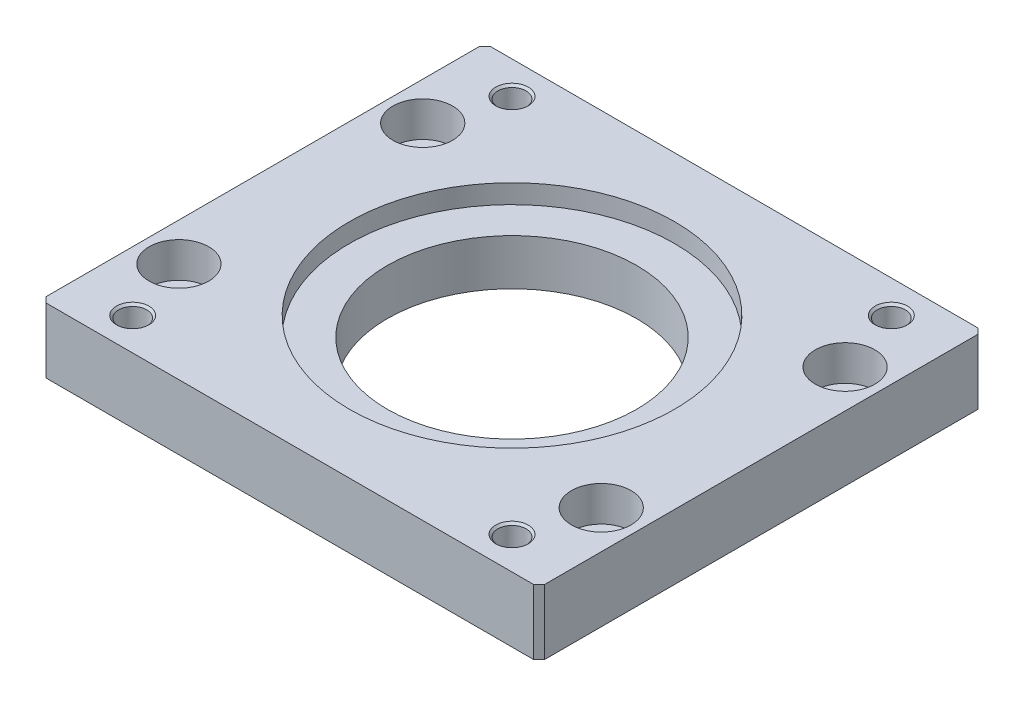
ISO-10303-21;
HEADER;
FILE_DESCRIPTION(('STEP AP214'),'2;1');
FILE_NAME('part.step','',(''),(''),'','','');
FILE_SCHEMA(('AUTOMOTIVE_DESIGN { 1 0 10303 214 1 1 1 1 }'));
ENDSEC;
DATA;
#1=APPLICATION_CONTEXT('core data for automotive mechanical design processes');
#2=APPLICATION_PROTOCOL_DEFINITION('international standard','automotive_design',2000,#1);
#3=PRODUCT_CONTEXT('',#1,'mechanical');
#4=PRODUCT('Part','Part','',(#3));
#5=PRODUCT_RELATED_PRODUCT_CATEGORY('part','',(#4));
#6=PRODUCT_DEFINITION_FORMATION('','',#4);
#7=PRODUCT_DEFINITION_CONTEXT('part definition',#1,'design');
#8=PRODUCT_DEFINITION('design','',#6,#7);
#9=PRODUCT_DEFINITION_SHAPE('','',#8);
#10=(LENGTH_UNIT() NAMED_UNIT(*) SI_UNIT(.MILLI.,.METRE.));
#11=(NAMED_UNIT(*) PLANE_ANGLE_UNIT() SI_UNIT($,.RADIAN.));
#12=(NAMED_UNIT(*) SI_UNIT($,.STERADIAN.) SOLID_ANGLE_UNIT());
#13=UNCERTAINTY_MEASURE_WITH_UNIT(LENGTH_MEASURE(1.E-05),#10,'distance_accuracy_value','');
#14=(GEOMETRIC_REPRESENTATION_CONTEXT(3) GLOBAL_UNCERTAINTY_ASSIGNED_CONTEXT((#13)) GLOBAL_UNIT_ASSIGNED_CONTEXT((#10,
#11,#12)) REPRESENTATION_CONTEXT('',''));
#15=CARTESIAN_POINT('',(0.,0.,0.));
#16=DIRECTION('',(0.,0.,1.));
#17=DIRECTION('',(1.,0.,0.));
#18=AXIS2_PLACEMENT_3D('',#15,#16,#17);
#19=CARTESIAN_POINT('',(-35.,11.6,35.));
#20=DIRECTION('',(0.,1.,0.));
#21=DIRECTION('',(0.,0.,1.));
#22=AXIS2_PLACEMENT_3D('',#19,#20,#21);
#23=CONICAL_SURFACE('',#22,2.59999999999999,0.785398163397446);
#24=CARTESIAN_POINT('',(-35.,11.6,35.));
#25=DIRECTION('',(0.,1.,0.));
#26=DIRECTION('',(1.,0.,0.));
#27=AXIS2_PLACEMENT_3D('',#24,#25,#26);
#28=CIRCLE('',#27,2.6);
#29=CARTESIAN_POINT('',(-32.4,11.6,35.));
#30=VERTEX_POINT('',#29);
#31=EDGE_CURVE('E169',#30,#30,#28,.F.);
#32=ORIENTED_EDGE('',*,*,#31,.T.);
#33=EDGE_LOOP('',(#32));
#34=FACE_BOUND('',#33,.T.);
#35=CARTESIAN_POINT('',(-35.,12.,35.));
#36=DIRECTION('',(0.,1.,0.));
#37=DIRECTION('',(0.,0.,1.));
#38=AXIS2_PLACEMENT_3D('',#35,#36,#37);
#39=CIRCLE('',#38,3.);
#40=CARTESIAN_POINT('',(-35.,12.,38.));
#41=VERTEX_POINT('',#40);
#42=EDGE_CURVE('E188',#41,#41,#39,.T.);
#43=ORIENTED_EDGE('',*,*,#42,.T.);
#44=EDGE_LOOP('',(#43));
#45=FACE_BOUND('',#44,.T.);
#46=ADVANCED_FACE('F16',(#34,#45),#23,.F.);
#47=CARTESIAN_POINT('',(35.,11.6,35.));
#48=DIRECTION('',(0.,1.,0.));
#49=DIRECTION('',(0.,0.,1.));
#50=AXIS2_PLACEMENT_3D('',#47,#48,#49);
#51=CONICAL_SURFACE('',#50,2.6,0.785398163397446);
#52=CARTESIAN_POINT('',(35.,11.6,35.));
#53=DIRECTION('',(0.,1.,0.));
#54=DIRECTION('',(1.,0.,0.));
#55=AXIS2_PLACEMENT_3D('',#52,#53,#54);
#56=CIRCLE('',#55,2.6);
#57=CARTESIAN_POINT('',(37.6,11.6,35.));
#58=VERTEX_POINT('',#57);
#59=EDGE_CURVE('E241',#58,#58,#56,.F.);
#60=ORIENTED_EDGE('',*,*,#59,.T.);
#61=EDGE_LOOP('',(#60));
#62=FACE_BOUND('',#61,.T.);
#63=CARTESIAN_POINT('',(35.,12.,35.));
#64=DIRECTION('',(0.,1.,0.));
#65=DIRECTION('',(0.,0.,1.));
#66=AXIS2_PLACEMENT_3D('',#63,#64,#65);
#67=CIRCLE('',#66,3.);
#68=CARTESIAN_POINT('',(35.,12.,38.));
#69=VERTEX_POINT('',#68);
#70=EDGE_CURVE('E185',#69,#69,#67,.T.);
#71=ORIENTED_EDGE('',*,*,#70,.T.);
#72=EDGE_LOOP('',(#71));
#73=FACE_BOUND('',#72,.T.);
#74=ADVANCED_FACE('F342',(#62,#73),#51,.F.);
#75=CARTESIAN_POINT('',(35.,11.6,-35.));
#76=DIRECTION('',(0.,1.,0.));
#77=DIRECTION('',(0.,0.,1.));
#78=AXIS2_PLACEMENT_3D('',#75,#76,#77);
#79=CONICAL_SURFACE('',#78,2.6,0.785398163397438);
#80=CARTESIAN_POINT('',(35.,11.6,-35.));
#81=DIRECTION('',(0.,1.,0.));
#82=DIRECTION('',(1.,0.,0.));
#83=AXIS2_PLACEMENT_3D('',#80,#81,#82);
#84=CIRCLE('',#83,2.6);
#85=CARTESIAN_POINT('',(37.6,11.6,-35.));
#86=VERTEX_POINT('',#85);
#87=EDGE_CURVE('E238',#86,#86,#84,.F.);
#88=ORIENTED_EDGE('',*,*,#87,.T.);
#89=EDGE_LOOP('',(#88));
#90=FACE_BOUND('',#89,.T.);
#91=CARTESIAN_POINT('',(35.,12.,-35.));
#92=DIRECTION('',(0.,1.,0.));
#93=DIRECTION('',(0.,0.,1.));
#94=AXIS2_PLACEMENT_3D('',#91,#92,#93);
#95=CIRCLE('',#94,3.);
#96=CARTESIAN_POINT('',(35.,12.,-32.));
#97=VERTEX_POINT('',#96);
#98=EDGE_CURVE('E191',#97,#97,#95,.T.);
#99=ORIENTED_EDGE('',*,*,#98,.T.);
#100=EDGE_LOOP('',(#99));
#101=FACE_BOUND('',#100,.T.);
#102=ADVANCED_FACE('F346',(#90,#101),#79,.F.);
#103=CARTESIAN_POINT('',(-35.,11.6,-35.));
#104=DIRECTION('',(0.,1.,0.));
#105=DIRECTION('',(0.,0.,1.));
#106=AXIS2_PLACEMENT_3D('',#103,#104,#105);
#107=CONICAL_SURFACE('',#106,2.6,0.785398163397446);
#108=CARTESIAN_POINT('',(-35.,11.6,-35.));
#109=DIRECTION('',(0.,1.,0.));
#110=DIRECTION('',(1.,0.,0.));
#111=AXIS2_PLACEMENT_3D('',#108,#109,#110);
#112=CIRCLE('',#111,2.6);
#113=CARTESIAN_POINT('',(-32.4,11.6,-35.));
#114=VERTEX_POINT('',#113);
#115=EDGE_CURVE('E165',#114,#114,#112,.F.);
#116=ORIENTED_EDGE('',*,*,#115,.T.);
#117=EDGE_LOOP('',(#116));
#118=FACE_BOUND('',#117,.T.);
#119=CARTESIAN_POINT('',(-35.,12.,-35.));
#120=DIRECTION('',(0.,1.,0.));
#121=DIRECTION('',(0.,0.,1.));
#122=AXIS2_PLACEMENT_3D('',#119,#120,#121);
#123=CIRCLE('',#122,3.);
#124=CARTESIAN_POINT('',(-35.,12.,-32.));
#125=VERTEX_POINT('',#124);
#126=EDGE_CURVE('E170',#125,#125,#123,.T.);
#127=ORIENTED_EDGE('',*,*,#126,.T.);
#128=EDGE_LOOP('',(#127));
#129=FACE_BOUND('',#128,.T.);
#130=ADVANCED_FACE('F350',(#118,#129),#107,.F.);
#131=CARTESIAN_POINT('',(38.9711431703,5.5,-22.5));
#132=DIRECTION('',(0.,1.,0.));
#133=DIRECTION('',(0.,0.,1.));
#134=AXIS2_PLACEMENT_3D('',#131,#132,#133);
#135=CYLINDRICAL_SURFACE('',#134,5.49999999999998);
#136=CARTESIAN_POINT('',(38.9711431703,5.5,-22.5));
#137=DIRECTION('',(0.,1.,0.));
#138=DIRECTION('',(0.,0.,1.));
#139=AXIS2_PLACEMENT_3D('',#136,#137,#138);
#140=CIRCLE('',#139,5.49999999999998);
#141=CARTESIAN_POINT('',(38.9711431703,5.5,-17.));
#142=VERTEX_POINT('',#141);
#143=EDGE_CURVE('E162',#142,#142,#140,.F.);
#144=ORIENTED_EDGE('',*,*,#143,.T.);
#145=EDGE_LOOP('',(#144));
#146=FACE_BOUND('',#145,.T.);
#147=CARTESIAN_POINT('',(38.9711431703,12.,-22.5));
#148=DIRECTION('',(0.,1.,0.));
#149=DIRECTION('',(0.,0.,1.));
#150=AXIS2_PLACEMENT_3D('',#147,#148,#149);
#151=CIRCLE('',#150,5.49999999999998);
#152=CARTESIAN_POINT('',(38.9711431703,12.,-17.));
#153=VERTEX_POINT('',#152);
#154=EDGE_CURVE('E182',#153,#153,#151,.T.);
#155=ORIENTED_EDGE('',*,*,#154,.T.);
#156=EDGE_LOOP('',(#155));
#157=FACE_BOUND('',#156,.T.);
#158=ADVANCED_FACE('F354',(#146,#157),#135,.F.);
#159=CARTESIAN_POINT('',(38.9711431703,5.5,22.5));
#160=DIRECTION('',(0.,1.,0.));
#161=DIRECTION('',(0.,0.,1.));
#162=AXIS2_PLACEMENT_3D('',#159,#160,#161);
#163=CYLINDRICAL_SURFACE('',#162,5.49999999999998);
#164=CARTESIAN_POINT('',(38.9711431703,5.5,22.5));
#165=DIRECTION('',(0.,1.,0.));
#166=DIRECTION('',(0.,0.,1.));
#167=AXIS2_PLACEMENT_3D('',#164,#165,#166);
#168=CIRCLE('',#167,5.49999999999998);
#169=CARTESIAN_POINT('',(38.9711431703,5.5,28.));
#170=VERTEX_POINT('',#169);
#171=EDGE_CURVE('E159',#170,#170,#168,.F.);
#172=ORIENTED_EDGE('',*,*,#171,.T.);
#173=EDGE_LOOP('',(#172));
#174=FACE_BOUND('',#173,.T.);
#175=CARTESIAN_POINT('',(38.9711431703,12.,22.5));
#176=DIRECTION('',(0.,1.,0.));
#177=DIRECTION('',(0.,0.,1.));
#178=AXIS2_PLACEMENT_3D('',#175,#176,#177);
#179=CIRCLE('',#178,5.49999999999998);
#180=CARTESIAN_POINT('',(38.9711431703,12.,28.));
#181=VERTEX_POINT('',#180);
#182=EDGE_CURVE('E173',#181,#181,#179,.T.);
#183=ORIENTED_EDGE('',*,*,#182,.T.);
#184=EDGE_LOOP('',(#183));
#185=FACE_BOUND('',#184,.T.);
#186=ADVANCED_FACE('F358',(#174,#185),#163,.F.);
#187=CARTESIAN_POINT('',(-38.9711431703,5.5,-22.5));
#188=DIRECTION('',(0.,1.,0.));
#189=DIRECTION('',(0.,0.,1.));
#190=AXIS2_PLACEMENT_3D('',#187,#188,#189);
#191=CYLINDRICAL_SURFACE('',#190,5.49999999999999);
#192=CARTESIAN_POINT('',(-38.9711431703,5.5,-22.5));
#193=DIRECTION('',(0.,1.,0.));
#194=DIRECTION('',(0.,0.,1.));
#195=AXIS2_PLACEMENT_3D('',#192,#193,#194);
#196=CIRCLE('',#195,5.49999999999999);
#197=CARTESIAN_POINT('',(-38.9711431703,5.5,-17.));
#198=VERTEX_POINT('',#197);
#199=EDGE_CURVE('E156',#198,#198,#196,.F.);
#200=ORIENTED_EDGE('',*,*,#199,.T.);
#201=EDGE_LOOP('',(#200));
#202=FACE_BOUND('',#201,.T.);
#203=CARTESIAN_POINT('',(-38.9711431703,12.,-22.5));
#204=DIRECTION('',(0.,1.,0.));
#205=DIRECTION('',(0.,0.,1.));
#206=AXIS2_PLACEMENT_3D('',#203,#204,#205);
#207=CIRCLE('',#206,5.49999999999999);
#208=CARTESIAN_POINT('',(-38.9711431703,12.,-17.));
#209=VERTEX_POINT('',#208);
#210=EDGE_CURVE('E179',#209,#209,#207,.T.);
#211=ORIENTED_EDGE('',*,*,#210,.T.);
#212=EDGE_LOOP('',(#211));
#213=FACE_BOUND('',#212,.T.);
#214=ADVANCED_FACE('F362',(#202,#213),#191,.F.);
#215=CARTESIAN_POINT('',(-38.9711431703,5.5,22.5));
#216=DIRECTION('',(0.,1.,0.));
#217=DIRECTION('',(0.,0.,1.));
#218=AXIS2_PLACEMENT_3D('',#215,#216,#217);
#219=CYLINDRICAL_SURFACE('',#218,5.49999999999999);
#220=CARTESIAN_POINT('',(-38.9711431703,5.5,22.5));
#221=DIRECTION('',(0.,1.,0.));
#222=DIRECTION('',(0.,0.,1.));
#223=AXIS2_PLACEMENT_3D('',#220,#221,#222);
#224=CIRCLE('',#223,5.49999999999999);
#225=CARTESIAN_POINT('',(-38.9711431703,5.5,28.));
#226=VERTEX_POINT('',#225);
#227=EDGE_CURVE('E104',#226,#226,#224,.F.);
#228=ORIENTED_EDGE('',*,*,#227,.T.);
#229=EDGE_LOOP('',(#228));
#230=FACE_BOUND('',#229,.T.);
#231=CARTESIAN_POINT('',(-38.9711431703,12.,22.5));
#232=DIRECTION('',(0.,1.,0.));
#233=DIRECTION('',(0.,0.,1.));
#234=AXIS2_PLACEMENT_3D('',#231,#232,#233);
#235=CIRCLE('',#234,5.49999999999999);
#236=CARTESIAN_POINT('',(-38.9711431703,12.,28.));
#237=VERTEX_POINT('',#236);
#238=EDGE_CURVE('E176',#237,#237,#235,.T.);
#239=ORIENTED_EDGE('',*,*,#238,.T.);
#240=EDGE_LOOP('',(#239));
#241=FACE_BOUND('',#240,.T.);
#242=ADVANCED_FACE('F366',(#230,#241),#219,.F.);
#243=CARTESIAN_POINT('',(0.,8.5,0.));
#244=DIRECTION('',(0.,1.,0.));
#245=DIRECTION('',(0.,0.,1.));
#246=AXIS2_PLACEMENT_3D('',#243,#244,#245);
#247=CYLINDRICAL_SURFACE('',#246,30.);
#248=CARTESIAN_POINT('',(0.,8.5,0.));
#249=DIRECTION('',(0.,1.,0.));
#250=DIRECTION('',(0.,0.,1.));
#251=AXIS2_PLACEMENT_3D('',#248,#249,#250);
#252=CIRCLE('',#251,30.);
#253=CARTESIAN_POINT('',(0.,8.5,30.));
#254=VERTEX_POINT('',#253);
#255=EDGE_CURVE('E101',#254,#254,#252,.F.);
#256=ORIENTED_EDGE('',*,*,#255,.T.);
#257=EDGE_LOOP('',(#256));
#258=FACE_BOUND('',#257,.T.);
#259=CARTESIAN_POINT('',(0.,12.,0.));
#260=DIRECTION('',(0.,1.,0.));
#261=DIRECTION('',(0.,0.,1.));
#262=AXIS2_PLACEMENT_3D('',#259,#260,#261);
#263=CIRCLE('',#262,30.);
#264=CARTESIAN_POINT('',(0.,12.,30.));
#265=VERTEX_POINT('',#264);
#266=EDGE_CURVE('E166',#265,#265,#263,.T.);
#267=ORIENTED_EDGE('',*,*,#266,.T.);
#268=EDGE_LOOP('',(#267));
#269=FACE_BOUND('',#268,.T.);
#270=ADVANCED_FACE('F339',(#258,#269),#247,.F.);
#271=CARTESIAN_POINT('',(-46.11502949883,12.24,-39.88497050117));
#272=DIRECTION('',(-0.707106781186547,0.,-0.707106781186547));
#273=DIRECTION('',(0.707106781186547,0.,-0.707106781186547));
#274=AXIS2_PLACEMENT_3D('',#271,#272,#273);
#275=PLANE('',#274);
#276=DIRECTION('',(0.707106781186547,0.,-0.707106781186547));
#277=VECTOR('',#276,1.);
#278=CARTESIAN_POINT('',(-46.11502949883,12.,-39.88497050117));
#279=LINE('',#278,#277);
#280=CARTESIAN_POINT('',(-46.,12.,-40.));
#281=VERTEX_POINT('',#280);
#282=CARTESIAN_POINT('',(-45.,12.,-41.));
#283=VERTEX_POINT('',#282);
#284=EDGE_CURVE('E194',#281,#283,#279,.T.);
#285=ORIENTED_EDGE('',*,*,#284,.T.);
#286=DIRECTION('',(0.,1.,0.));
#287=VECTOR('',#286,1.);
#288=CARTESIAN_POINT('',(-45.,6.,-41.));
#289=LINE('',#288,#287);
#290=CARTESIAN_POINT('',(-45.,0.,-41.));
#291=VERTEX_POINT('',#290);
#292=EDGE_CURVE('E97',#283,#291,#289,.F.);
#293=ORIENTED_EDGE('',*,*,#292,.T.);
#294=DIRECTION('',(-0.707106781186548,0.,0.707106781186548));
#295=VECTOR('',#294,1.);
#296=CARTESIAN_POINT('',(-45.5,0.,-40.5));
#297=LINE('',#296,#295);
#298=CARTESIAN_POINT('',(-46.,0.,-40.));
#299=VERTEX_POINT('',#298);
#300=EDGE_CURVE('E234',#299,#291,#297,.F.);
#301=ORIENTED_EDGE('',*,*,#300,.F.);
#302=DIRECTION('',(0.,-1.,0.));
#303=VECTOR('',#302,1.);
#304=CARTESIAN_POINT('',(-46.,6.,-40.));
#305=LINE('',#304,#303);
#306=EDGE_CURVE('E247',#299,#281,#305,.F.);
#307=ORIENTED_EDGE('',*,*,#306,.T.);
#308=EDGE_LOOP('',(#285,#293,#301,#307));
#309=FACE_BOUND('',#308,.T.);
#310=ADVANCED_FACE('F250',(#309),#275,.T.);
#311=CARTESIAN_POINT('',(-44.88497050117,12.24,41.11502949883));
#312=DIRECTION('',(-0.707106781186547,0.,0.707106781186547));
#313=DIRECTION('',(-0.707106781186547,0.,-0.707106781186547));
#314=AXIS2_PLACEMENT_3D('',#311,#312,#313);
#315=PLANE('',#314);
#316=DIRECTION('',(-0.707106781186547,0.,-0.707106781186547));
#317=VECTOR('',#316,1.);
#318=CARTESIAN_POINT('',(-44.88497050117,12.,41.11502949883));
#319=LINE('',#318,#317);
#320=CARTESIAN_POINT('',(-45.,12.,41.));
#321=VERTEX_POINT('',#320);
#322=CARTESIAN_POINT('',(-46.,12.,40.));
#323=VERTEX_POINT('',#322);
#324=EDGE_CURVE('E196',#321,#323,#319,.T.);
#325=ORIENTED_EDGE('',*,*,#324,.T.);
#326=DIRECTION('',(0.,1.,0.));
#327=VECTOR('',#326,1.);
#328=CARTESIAN_POINT('',(-46.,6.,40.));
#329=LINE('',#328,#327);
#330=CARTESIAN_POINT('',(-46.,0.,40.));
#331=VERTEX_POINT('',#330);
#332=EDGE_CURVE('E212',#323,#331,#329,.F.);
#333=ORIENTED_EDGE('',*,*,#332,.T.);
#334=DIRECTION('',(0.707106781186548,0.,0.707106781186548));
#335=VECTOR('',#334,1.);
#336=CARTESIAN_POINT('',(-45.5,0.,40.5));
#337=LINE('',#336,#335);
#338=CARTESIAN_POINT('',(-45.,0.,41.));
#339=VERTEX_POINT('',#338);
#340=EDGE_CURVE('E232',#339,#331,#337,.F.);
#341=ORIENTED_EDGE('',*,*,#340,.F.);
#342=DIRECTION('',(0.,-1.,0.));
#343=VECTOR('',#342,1.);
#344=CARTESIAN_POINT('',(-45.,6.,41.));
#345=LINE('',#344,#343);
#346=EDGE_CURVE('E210',#339,#321,#345,.F.);
#347=ORIENTED_EDGE('',*,*,#346,.T.);
#348=EDGE_LOOP('',(#325,#333,#341,#347));
#349=FACE_BOUND('',#348,.T.);
#350=ADVANCED_FACE('F333',(#349),#315,.T.);
#351=CARTESIAN_POINT('',(44.88497050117,12.24,-41.11502949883));
#352=DIRECTION('',(0.707106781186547,0.,-0.707106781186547));
#353=DIRECTION('',(0.707106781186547,0.,0.707106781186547));
#354=AXIS2_PLACEMENT_3D('',#351,#352,#353);
#355=PLANE('',#354);
#356=DIRECTION('',(0.707106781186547,0.,0.707106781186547));
#357=VECTOR('',#356,1.);
#358=CARTESIAN_POINT('',(44.88497050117,12.,-41.11502949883));
#359=LINE('',#358,#357);
#360=CARTESIAN_POINT('',(45.,12.,-41.));
#361=VERTEX_POINT('',#360);
#362=CARTESIAN_POINT('',(46.,12.,-40.));
#363=VERTEX_POINT('',#362);
#364=EDGE_CURVE('E20',#361,#363,#359,.T.);
#365=ORIENTED_EDGE('',*,*,#364,.T.);
#366=DIRECTION('',(0.,1.,0.));
#367=VECTOR('',#366,1.);
#368=CARTESIAN_POINT('',(46.,6.,-40.));
#369=LINE('',#368,#367);
#370=CARTESIAN_POINT('',(46.,0.,-40.));
#371=VERTEX_POINT('',#370);
#372=EDGE_CURVE('E110',#363,#371,#369,.F.);
#373=ORIENTED_EDGE('',*,*,#372,.T.);
#374=DIRECTION('',(-0.707106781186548,0.,-0.707106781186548));
#375=VECTOR('',#374,1.);
#376=CARTESIAN_POINT('',(45.5,0.,-40.5));
#377=LINE('',#376,#375);
#378=CARTESIAN_POINT('',(45.,0.,-41.));
#379=VERTEX_POINT('',#378);
#380=EDGE_CURVE('E100',#379,#371,#377,.F.);
#381=ORIENTED_EDGE('',*,*,#380,.F.);
#382=DIRECTION('',(0.,-1.,0.));
#383=VECTOR('',#382,1.);
#384=CARTESIAN_POINT('',(45.,6.,-41.));
#385=LINE('',#384,#383);
#386=EDGE_CURVE('E94',#379,#361,#385,.F.);
#387=ORIENTED_EDGE('',*,*,#386,.T.);
#388=EDGE_LOOP('',(#365,#373,#381,#387));
#389=FACE_BOUND('',#388,.T.);
#390=ADVANCED_FACE('F99',(#389),#355,.T.);
#391=CARTESIAN_POINT('',(46.11502949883,12.24,39.88497050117));
#392=DIRECTION('',(0.707106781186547,0.,0.707106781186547));
#393=DIRECTION('',(-0.707106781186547,0.,0.707106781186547));
#394=AXIS2_PLACEMENT_3D('',#391,#392,#393);
#395=PLANE('',#394);
#396=DIRECTION('',(-0.707106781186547,0.,0.707106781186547));
#397=VECTOR('',#396,1.);
#398=CARTESIAN_POINT('',(46.11502949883,12.,39.88497050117));
#399=LINE('',#398,#397);
#400=CARTESIAN_POINT('',(46.,12.,40.));
#401=VERTEX_POINT('',#400);
#402=CARTESIAN_POINT('',(45.,12.,41.));
#403=VERTEX_POINT('',#402);
#404=EDGE_CURVE('E88',#401,#403,#399,.T.);
#405=ORIENTED_EDGE('',*,*,#404,.T.);
#406=DIRECTION('',(0.,1.,0.));
#407=VECTOR('',#406,1.);
#408=CARTESIAN_POINT('',(45.,6.,41.));
#409=LINE('',#408,#407);
#410=CARTESIAN_POINT('',(45.,0.,41.));
#411=VERTEX_POINT('',#410);
#412=EDGE_CURVE('E108',#403,#411,#409,.F.);
#413=ORIENTED_EDGE('',*,*,#412,.T.);
#414=DIRECTION('',(0.707106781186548,0.,-0.707106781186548));
#415=VECTOR('',#414,1.);
#416=CARTESIAN_POINT('',(45.5,0.,40.5));
#417=LINE('',#416,#415);
#418=CARTESIAN_POINT('',(46.,0.,40.));
#419=VERTEX_POINT('',#418);
#420=EDGE_CURVE('E35',#419,#411,#417,.F.);
#421=ORIENTED_EDGE('',*,*,#420,.F.);
#422=DIRECTION('',(0.,-1.,0.));
#423=VECTOR('',#422,1.);
#424=CARTESIAN_POINT('',(46.,6.,40.));
#425=LINE('',#424,#423);
#426=EDGE_CURVE('E111',#419,#401,#425,.F.);
#427=ORIENTED_EDGE('',*,*,#426,.T.);
#428=EDGE_LOOP('',(#405,#413,#421,#427));
#429=FACE_BOUND('',#428,.T.);
#430=ADVANCED_FACE('F198',(#429),#395,.T.);
#431=CARTESIAN_POINT('',(-47.84,12.,42.64));
#432=DIRECTION('',(0.,1.,0.));
#433=DIRECTION('',(1.,0.,0.));
#434=AXIS2_PLACEMENT_3D('',#431,#432,#433);
#435=PLANE('',#434);
#436=ORIENTED_EDGE('',*,*,#266,.F.);
#437=EDGE_LOOP('',(#436));
#438=FACE_BOUND('',#437,.T.);
#439=ORIENTED_EDGE('',*,*,#126,.F.);
#440=EDGE_LOOP('',(#439));
#441=FACE_BOUND('',#440,.T.);
#442=ORIENTED_EDGE('',*,*,#182,.F.);
#443=EDGE_LOOP('',(#442));
#444=FACE_BOUND('',#443,.T.);
#445=ORIENTED_EDGE('',*,*,#238,.F.);
#446=EDGE_LOOP('',(#445));
#447=FACE_BOUND('',#446,.T.);
#448=ORIENTED_EDGE('',*,*,#210,.F.);
#449=EDGE_LOOP('',(#448));
#450=FACE_BOUND('',#449,.T.);
#451=ORIENTED_EDGE('',*,*,#154,.F.);
#452=EDGE_LOOP('',(#451));
#453=FACE_BOUND('',#452,.T.);
#454=ORIENTED_EDGE('',*,*,#70,.F.);
#455=EDGE_LOOP('',(#454));
#456=FACE_BOUND('',#455,.T.);
#457=ORIENTED_EDGE('',*,*,#42,.F.);
#458=EDGE_LOOP('',(#457));
#459=FACE_BOUND('',#458,.T.);
#460=ORIENTED_EDGE('',*,*,#98,.F.);
#461=EDGE_LOOP('',(#460));
#462=FACE_BOUND('',#461,.T.);
#463=ORIENTED_EDGE('',*,*,#284,.F.);
#464=DIRECTION('',(0.,0.,-1.));
#465=VECTOR('',#464,1.);
#466=CARTESIAN_POINT('',(-46.,12.,0.));
#467=LINE('',#466,#465);
#468=EDGE_CURVE('E218',#281,#323,#467,.F.);
#469=ORIENTED_EDGE('',*,*,#468,.T.);
#470=ORIENTED_EDGE('',*,*,#324,.F.);
#471=DIRECTION('',(-1.,0.,0.));
#472=VECTOR('',#471,1.);
#473=CARTESIAN_POINT('',(0.,12.,41.));
#474=LINE('',#473,#472);
#475=EDGE_CURVE('E205',#321,#403,#474,.F.);
#476=ORIENTED_EDGE('',*,*,#475,.T.);
#477=ORIENTED_EDGE('',*,*,#404,.F.);
#478=DIRECTION('',(0.,0.,1.));
#479=VECTOR('',#478,1.);
#480=CARTESIAN_POINT('',(46.,12.,0.));
#481=LINE('',#480,#479);
#482=EDGE_CURVE('E84',#401,#363,#481,.F.);
#483=ORIENTED_EDGE('',*,*,#482,.T.);
#484=ORIENTED_EDGE('',*,*,#364,.F.);
#485=DIRECTION('',(1.,0.,0.));
#486=VECTOR('',#485,1.);
#487=CARTESIAN_POINT('',(0.,12.,-41.));
#488=LINE('',#487,#486);
#489=EDGE_CURVE('E82',#361,#283,#488,.F.);
#490=ORIENTED_EDGE('',*,*,#489,.T.);
#491=EDGE_LOOP('',(#463,#469,#470,#476,#477,#483,#484,#490));
#492=FACE_BOUND('',#491,.T.);
#493=ADVANCED_FACE('F81',(#438,#441,#444,#447,#450,#453,#456,#459,#462,#492),#435,.T.);
#494=CARTESIAN_POINT('',(-35.,0.399999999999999,35.));
#495=DIRECTION('',(0.,1.,0.));
#496=DIRECTION('',(0.,0.,1.));
#497=AXIS2_PLACEMENT_3D('',#494,#495,#496);
#498=CYLINDRICAL_SURFACE('',#497,2.6);
#499=CARTESIAN_POINT('',(-35.,0.399999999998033,35.));
#500=DIRECTION('',(0.,-1.,0.));
#501=DIRECTION('',(0.,0.,-1.));
#502=AXIS2_PLACEMENT_3D('',#499,#500,#501);
#503=CIRCLE('',#502,2.59999999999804);
#504=CARTESIAN_POINT('',(-35.,0.399999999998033,32.400000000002));
#505=VERTEX_POINT('',#504);
#506=EDGE_CURVE('E219',#505,#505,#503,.T.);
#507=ORIENTED_EDGE('',*,*,#506,.T.);
#508=EDGE_LOOP('',(#507));
#509=FACE_BOUND('',#508,.T.);
#510=ORIENTED_EDGE('',*,*,#31,.F.);
#511=EDGE_LOOP('',(#510));
#512=FACE_BOUND('',#511,.T.);
#513=ADVANCED_FACE('F327',(#509,#512),#498,.F.);
#514=CARTESIAN_POINT('',(35.,0.399999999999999,35.));
#515=DIRECTION('',(0.,1.,0.));
#516=DIRECTION('',(0.,0.,1.));
#517=AXIS2_PLACEMENT_3D('',#514,#515,#516);
#518=CYLINDRICAL_SURFACE('',#517,2.6);
#519=CARTESIAN_POINT('',(35.,0.399999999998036,35.));
#520=DIRECTION('',(0.,-1.,0.));
#521=DIRECTION('',(0.,0.,-1.));
#522=AXIS2_PLACEMENT_3D('',#519,#520,#521);
#523=CIRCLE('',#522,2.59999999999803);
#524=CARTESIAN_POINT('',(35.,0.399999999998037,32.400000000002));
#525=VERTEX_POINT('',#524);
#526=EDGE_CURVE('E221',#525,#525,#523,.T.);
#527=ORIENTED_EDGE('',*,*,#526,.T.);
#528=EDGE_LOOP('',(#527));
#529=FACE_BOUND('',#528,.T.);
#530=ORIENTED_EDGE('',*,*,#59,.F.);
#531=EDGE_LOOP('',(#530));
#532=FACE_BOUND('',#531,.T.);
#533=ADVANCED_FACE('F376',(#529,#532),#518,.F.);
#534=CARTESIAN_POINT('',(35.,0.399999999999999,-35.));
#535=DIRECTION('',(0.,1.,0.));
#536=DIRECTION('',(0.,0.,1.));
#537=AXIS2_PLACEMENT_3D('',#534,#535,#536);
#538=CYLINDRICAL_SURFACE('',#537,2.6);
#539=CARTESIAN_POINT('',(35.,0.399999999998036,-35.));
#540=DIRECTION('',(0.,-1.,0.));
#541=DIRECTION('',(0.,0.,-1.));
#542=AXIS2_PLACEMENT_3D('',#539,#540,#541);
#543=CIRCLE('',#542,2.59999999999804);
#544=CARTESIAN_POINT('',(35.,0.399999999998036,-37.599999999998));
#545=VERTEX_POINT('',#544);
#546=EDGE_CURVE('E226',#545,#545,#543,.T.);
#547=ORIENTED_EDGE('',*,*,#546,.T.);
#548=EDGE_LOOP('',(#547));
#549=FACE_BOUND('',#548,.T.);
#550=ORIENTED_EDGE('',*,*,#87,.F.);
#551=EDGE_LOOP('',(#550));
#552=FACE_BOUND('',#551,.T.);
#553=ADVANCED_FACE('F263',(#549,#552),#538,.F.);
#554=CARTESIAN_POINT('',(-35.,0.399999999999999,-35.));
#555=DIRECTION('',(0.,1.,0.));
#556=DIRECTION('',(0.,0.,1.));
#557=AXIS2_PLACEMENT_3D('',#554,#555,#556);
#558=CYLINDRICAL_SURFACE('',#557,2.6);
#559=CARTESIAN_POINT('',(-35.,0.399999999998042,-35.));
#560=DIRECTION('',(0.,-1.,0.));
#561=DIRECTION('',(0.,0.,-1.));
#562=AXIS2_PLACEMENT_3D('',#559,#560,#561);
#563=CIRCLE('',#562,2.59999999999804);
#564=CARTESIAN_POINT('',(-35.,0.399999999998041,-37.599999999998));
#565=VERTEX_POINT('',#564);
#566=EDGE_CURVE('E152',#565,#565,#563,.T.);
#567=ORIENTED_EDGE('',*,*,#566,.T.);
#568=EDGE_LOOP('',(#567));
#569=FACE_BOUND('',#568,.T.);
#570=ORIENTED_EDGE('',*,*,#115,.F.);
#571=EDGE_LOOP('',(#570));
#572=FACE_BOUND('',#571,.T.);
#573=ADVANCED_FACE('F323',(#569,#572),#558,.F.);
#574=CARTESIAN_POINT('',(-46.24998889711,5.5,29.13192006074));
#575=DIRECTION('',(0.,1.,0.));
#576=DIRECTION('',(1.,0.,0.));
#577=AXIS2_PLACEMENT_3D('',#574,#575,#576);
#578=PLANE('',#577);
#579=CARTESIAN_POINT('',(38.9711431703,5.5,-22.5));
#580=DIRECTION('',(0.,1.,0.));
#581=DIRECTION('',(0.,0.,1.));
#582=AXIS2_PLACEMENT_3D('',#579,#580,#581);
#583=CIRCLE('',#582,3.24999999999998);
#584=CARTESIAN_POINT('',(38.9711431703,5.5,-19.25));
#585=VERTEX_POINT('',#584);
#586=EDGE_CURVE('E150',#585,#585,#583,.F.);
#587=ORIENTED_EDGE('',*,*,#586,.T.);
#588=EDGE_LOOP('',(#587));
#589=FACE_BOUND('',#588,.T.);
#590=ORIENTED_EDGE('',*,*,#143,.F.);
#591=EDGE_LOOP('',(#590));
#592=FACE_BOUND('',#591,.T.);
#593=ADVANCED_FACE('F319',(#589,#592),#578,.T.);
#594=CARTESIAN_POINT('',(-46.24998889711,5.5,29.13192006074));
#595=DIRECTION('',(0.,1.,0.));
#596=DIRECTION('',(1.,0.,0.));
#597=AXIS2_PLACEMENT_3D('',#594,#595,#596);
#598=PLANE('',#597);
#599=CARTESIAN_POINT('',(38.9711431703,5.5,22.5));
#600=DIRECTION('',(0.,1.,0.));
#601=DIRECTION('',(0.,0.,1.));
#602=AXIS2_PLACEMENT_3D('',#599,#600,#601);
#603=CIRCLE('',#602,3.24999999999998);
#604=CARTESIAN_POINT('',(38.9711431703,5.5,25.75));
#605=VERTEX_POINT('',#604);
#606=EDGE_CURVE('E147',#605,#605,#603,.F.);
#607=ORIENTED_EDGE('',*,*,#606,.T.);
#608=EDGE_LOOP('',(#607));
#609=FACE_BOUND('',#608,.T.);
#610=ORIENTED_EDGE('',*,*,#171,.F.);
#611=EDGE_LOOP('',(#610));
#612=FACE_BOUND('',#611,.T.);
#613=ADVANCED_FACE('F315',(#609,#612),#598,.T.);
#614=CARTESIAN_POINT('',(-46.24998889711,5.5,29.13192006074));
#615=DIRECTION('',(0.,1.,0.));
#616=DIRECTION('',(1.,0.,0.));
#617=AXIS2_PLACEMENT_3D('',#614,#615,#616);
#618=PLANE('',#617);
#619=CARTESIAN_POINT('',(-38.9711431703,5.5,-22.5));
#620=DIRECTION('',(0.,1.,0.));
#621=DIRECTION('',(0.,0.,1.));
#622=AXIS2_PLACEMENT_3D('',#619,#620,#621);
#623=CIRCLE('',#622,3.25);
#624=CARTESIAN_POINT('',(-38.9711431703,5.5,-19.25));
#625=VERTEX_POINT('',#624);
#626=EDGE_CURVE('E144',#625,#625,#623,.F.);
#627=ORIENTED_EDGE('',*,*,#626,.T.);
#628=EDGE_LOOP('',(#627));
#629=FACE_BOUND('',#628,.T.);
#630=ORIENTED_EDGE('',*,*,#199,.F.);
#631=EDGE_LOOP('',(#630));
#632=FACE_BOUND('',#631,.T.);
#633=ADVANCED_FACE('F311',(#629,#632),#618,.T.);
#634=CARTESIAN_POINT('',(-46.24998889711,5.5,29.13192006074));
#635=DIRECTION('',(0.,1.,0.));
#636=DIRECTION('',(1.,0.,0.));
#637=AXIS2_PLACEMENT_3D('',#634,#635,#636);
#638=PLANE('',#637);
#639=CARTESIAN_POINT('',(-38.9711431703,5.5,22.5));
#640=DIRECTION('',(0.,1.,0.));
#641=DIRECTION('',(0.,0.,1.));
#642=AXIS2_PLACEMENT_3D('',#639,#640,#641);
#643=CIRCLE('',#642,3.25);
#644=CARTESIAN_POINT('',(-38.9711431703,5.5,25.75));
#645=VERTEX_POINT('',#644);
#646=EDGE_CURVE('E141',#645,#645,#643,.F.);
#647=ORIENTED_EDGE('',*,*,#646,.T.);
#648=EDGE_LOOP('',(#647));
#649=FACE_BOUND('',#648,.T.);
#650=ORIENTED_EDGE('',*,*,#227,.F.);
#651=EDGE_LOOP('',(#650));
#652=FACE_BOUND('',#651,.T.);
#653=ADVANCED_FACE('F307',(#649,#652),#638,.T.);
#654=CARTESIAN_POINT('',(-31.2,8.5,31.2));
#655=DIRECTION('',(0.,1.,0.));
#656=DIRECTION('',(1.,0.,0.));
#657=AXIS2_PLACEMENT_3D('',#654,#655,#656);
#658=PLANE('',#657);
#659=CARTESIAN_POINT('',(0.,8.5,0.));
#660=DIRECTION('',(0.,1.,0.));
#661=DIRECTION('',(0.,0.,1.));
#662=AXIS2_PLACEMENT_3D('',#659,#660,#661);
#663=CIRCLE('',#662,23.);
#664=CARTESIAN_POINT('',(0.,8.5,23.));
#665=VERTEX_POINT('',#664);
#666=EDGE_CURVE('E137',#665,#665,#663,.F.);
#667=ORIENTED_EDGE('',*,*,#666,.T.);
#668=EDGE_LOOP('',(#667));
#669=FACE_BOUND('',#668,.T.);
#670=ORIENTED_EDGE('',*,*,#255,.F.);
#671=EDGE_LOOP('',(#670));
#672=FACE_BOUND('',#671,.T.);
#673=ADVANCED_FACE('F304',(#669,#672),#658,.T.);
#674=CARTESIAN_POINT('',(46.8,-0.24,-41.));
#675=DIRECTION('',(0.,0.,-1.));
#676=DIRECTION('',(-1.,0.,0.));
#677=AXIS2_PLACEMENT_3D('',#674,#675,#676);
#678=PLANE('',#677);
#679=ORIENTED_EDGE('',*,*,#292,.F.);
#680=ORIENTED_EDGE('',*,*,#489,.F.);
#681=ORIENTED_EDGE('',*,*,#386,.F.);
#682=DIRECTION('',(-1.,0.,0.));
#683=VECTOR('',#682,1.);
#684=CARTESIAN_POINT('',(0.,0.,-41.));
#685=LINE('',#684,#683);
#686=EDGE_CURVE('E140',#379,#291,#685,.T.);
#687=ORIENTED_EDGE('',*,*,#686,.T.);
#688=EDGE_LOOP('',(#679,#680,#681,#687));
#689=FACE_BOUND('',#688,.T.);
#690=ADVANCED_FACE('F92',(#689),#678,.T.);
#691=CARTESIAN_POINT('',(-46.,-0.24,-41.6));
#692=DIRECTION('',(-1.,0.,0.));
#693=DIRECTION('',(0.,0.,1.));
#694=AXIS2_PLACEMENT_3D('',#691,#692,#693);
#695=PLANE('',#694);
#696=ORIENTED_EDGE('',*,*,#332,.F.);
#697=ORIENTED_EDGE('',*,*,#468,.F.);
#698=ORIENTED_EDGE('',*,*,#306,.F.);
#699=DIRECTION('',(0.,0.,1.));
#700=VECTOR('',#699,1.);
#701=CARTESIAN_POINT('',(-46.,0.,0.));
#702=LINE('',#701,#700);
#703=EDGE_CURVE('E253',#299,#331,#702,.T.);
#704=ORIENTED_EDGE('',*,*,#703,.T.);
#705=EDGE_LOOP('',(#696,#697,#698,#704));
#706=FACE_BOUND('',#705,.T.);
#707=ADVANCED_FACE('F296',(#706),#695,.T.);
#708=CARTESIAN_POINT('',(-46.8,-0.24,41.));
#709=DIRECTION('',(0.,0.,1.));
#710=DIRECTION('',(1.,0.,0.));
#711=AXIS2_PLACEMENT_3D('',#708,#709,#710);
#712=PLANE('',#711);
#713=ORIENTED_EDGE('',*,*,#412,.F.);
#714=ORIENTED_EDGE('',*,*,#475,.F.);
#715=ORIENTED_EDGE('',*,*,#346,.F.);
#716=DIRECTION('',(1.,0.,0.));
#717=VECTOR('',#716,1.);
#718=CARTESIAN_POINT('',(0.,0.,41.));
#719=LINE('',#718,#717);
#720=EDGE_CURVE('E208',#339,#411,#719,.T.);
#721=ORIENTED_EDGE('',*,*,#720,.T.);
#722=EDGE_LOOP('',(#713,#714,#715,#721));
#723=FACE_BOUND('',#722,.T.);
#724=ADVANCED_FACE('F203',(#723),#712,.T.);
#725=CARTESIAN_POINT('',(46.,-0.24,41.6));
#726=DIRECTION('',(1.,0.,0.));
#727=DIRECTION('',(0.,0.,-1.));
#728=AXIS2_PLACEMENT_3D('',#725,#726,#727);
#729=PLANE('',#728);
#730=ORIENTED_EDGE('',*,*,#426,.F.);
#731=DIRECTION('',(0.,0.,-1.));
#732=VECTOR('',#731,1.);
#733=CARTESIAN_POINT('',(46.,0.,0.));
#734=LINE('',#733,#732);
#735=EDGE_CURVE('E136',#419,#371,#734,.T.);
#736=ORIENTED_EDGE('',*,*,#735,.T.);
#737=ORIENTED_EDGE('',*,*,#372,.F.);
#738=ORIENTED_EDGE('',*,*,#482,.F.);
#739=EDGE_LOOP('',(#730,#736,#737,#738));
#740=FACE_BOUND('',#739,.T.);
#741=ADVANCED_FACE('F286',(#740),#729,.T.);
#742=CARTESIAN_POINT('',(-35.,0.399999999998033,35.));
#743=DIRECTION('',(0.,-1.,0.));
#744=DIRECTION('',(0.,0.,-1.));
#745=AXIS2_PLACEMENT_3D('',#742,#743,#744);
#746=CONICAL_SURFACE('',#745,2.59999999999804,0.78539816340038);
#747=ORIENTED_EDGE('',*,*,#506,.F.);
#748=EDGE_LOOP('',(#747));
#749=FACE_BOUND('',#748,.T.);
#750=CARTESIAN_POINT('',(-35.,-7.90329173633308E-13,35.));
#751=DIRECTION('',(0.,-1.,0.));
#752=DIRECTION('',(1.,0.,0.));
#753=AXIS2_PLACEMENT_3D('',#750,#751,#752);
#754=CIRCLE('',#753,2.99999999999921);
#755=CARTESIAN_POINT('',(-32.0000000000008,-7.90360448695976E-13,35.));
#756=VERTEX_POINT('',#755);
#757=EDGE_CURVE('E133',#756,#756,#754,.T.);
#758=ORIENTED_EDGE('',*,*,#757,.T.);
#759=EDGE_LOOP('',(#758));
#760=FACE_BOUND('',#759,.T.);
#761=ADVANCED_FACE('F288',(#749,#760),#746,.F.);
#762=CARTESIAN_POINT('',(35.,0.399999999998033,35.));
#763=DIRECTION('',(0.,-1.,0.));
#764=DIRECTION('',(1.,0.,0.));
#765=AXIS2_PLACEMENT_3D('',#762,#763,#764);
#766=CONICAL_SURFACE('',#765,2.59999999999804,0.785398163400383);
#767=ORIENTED_EDGE('',*,*,#526,.F.);
#768=EDGE_LOOP('',(#767));
#769=FACE_BOUND('',#768,.T.);
#770=CARTESIAN_POINT('',(35.,-7.92714418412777E-13,35.));
#771=DIRECTION('',(0.,-1.,0.));
#772=DIRECTION('',(0.,0.,-1.));
#773=AXIS2_PLACEMENT_3D('',#770,#771,#772);
#774=CIRCLE('',#773,2.99999999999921);
#775=CARTESIAN_POINT('',(35.,-7.92714418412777E-13,32.0000000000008));
#776=VERTEX_POINT('',#775);
#777=EDGE_CURVE('E130',#776,#776,#774,.T.);
#778=ORIENTED_EDGE('',*,*,#777,.T.);
#779=EDGE_LOOP('',(#778));
#780=FACE_BOUND('',#779,.T.);
#781=ADVANCED_FACE('F270',(#769,#780),#766,.F.);
#782=CARTESIAN_POINT('',(35.,0.399999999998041,-35.));
#783=DIRECTION('',(0.,-1.,0.));
#784=DIRECTION('',(0.,0.,-1.));
#785=AXIS2_PLACEMENT_3D('',#782,#783,#784);
#786=CONICAL_SURFACE('',#785,2.59999999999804,0.78539816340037);
#787=ORIENTED_EDGE('',*,*,#546,.F.);
#788=EDGE_LOOP('',(#787));
#789=FACE_BOUND('',#788,.T.);
#790=CARTESIAN_POINT('',(35.,-7.80300303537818E-13,-35.));
#791=DIRECTION('',(0.,-1.,0.));
#792=DIRECTION('',(0.,0.,-1.));
#793=AXIS2_PLACEMENT_3D('',#790,#791,#792);
#794=CIRCLE('',#793,2.99999999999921);
#795=CARTESIAN_POINT('',(35.,-7.80300303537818E-13,-37.9999999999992));
#796=VERTEX_POINT('',#795);
#797=EDGE_CURVE('E127',#796,#796,#794,.T.);
#798=ORIENTED_EDGE('',*,*,#797,.T.);
#799=EDGE_LOOP('',(#798));
#800=FACE_BOUND('',#799,.T.);
#801=ADVANCED_FACE('F266',(#789,#800),#786,.F.);
#802=CARTESIAN_POINT('',(-35.,0.399999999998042,-35.));
#803=DIRECTION('',(0.,-1.,0.));
#804=DIRECTION('',(0.,0.,-1.));
#805=AXIS2_PLACEMENT_3D('',#802,#803,#804);
#806=CONICAL_SURFACE('',#805,2.59999999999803,0.785398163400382);
#807=ORIENTED_EDGE('',*,*,#566,.F.);
#808=EDGE_LOOP('',(#807));
#809=FACE_BOUND('',#808,.T.);
#810=CARTESIAN_POINT('',(-35.,-7.90274963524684E-13,-35.));
#811=DIRECTION('',(0.,-1.,0.));
#812=DIRECTION('',(0.,0.,-1.));
#813=AXIS2_PLACEMENT_3D('',#810,#811,#812);
#814=CIRCLE('',#813,2.99999999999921);
#815=CARTESIAN_POINT('',(-35.,-7.90274963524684E-13,-37.9999999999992));
#816=VERTEX_POINT('',#815);
#817=EDGE_CURVE('E124',#816,#816,#814,.T.);
#818=ORIENTED_EDGE('',*,*,#817,.T.);
#819=EDGE_LOOP('',(#818));
#820=FACE_BOUND('',#819,.T.);
#821=ADVANCED_FACE('F269',(#809,#820),#806,.F.);
#822=CARTESIAN_POINT('',(38.9711431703,0.,-22.5));
#823=DIRECTION('',(0.,1.,0.));
#824=DIRECTION('',(0.,0.,1.));
#825=AXIS2_PLACEMENT_3D('',#822,#823,#824);
#826=CYLINDRICAL_SURFACE('',#825,3.24999999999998);
#827=CARTESIAN_POINT('',(38.9711431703,0.,-22.5));
#828=DIRECTION('',(0.,1.,0.));
#829=DIRECTION('',(0.,0.,1.));
#830=AXIS2_PLACEMENT_3D('',#827,#828,#829);
#831=CIRCLE('',#830,3.24999999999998);
#832=CARTESIAN_POINT('',(38.9711431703,0.,-19.25));
#833=VERTEX_POINT('',#832);
#834=EDGE_CURVE('E121',#833,#833,#831,.F.);
#835=ORIENTED_EDGE('',*,*,#834,.T.);
#836=EDGE_LOOP('',(#835));
#837=FACE_BOUND('',#836,.T.);
#838=ORIENTED_EDGE('',*,*,#586,.F.);
#839=EDGE_LOOP('',(#838));
#840=FACE_BOUND('',#839,.T.);
#841=ADVANCED_FACE('F390',(#837,#840),#826,.F.);
#842=CARTESIAN_POINT('',(38.9711431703,0.,22.5));
#843=DIRECTION('',(0.,1.,0.));
#844=DIRECTION('',(0.,0.,1.));
#845=AXIS2_PLACEMENT_3D('',#842,#843,#844);
#846=CYLINDRICAL_SURFACE('',#845,3.24999999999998);
#847=CARTESIAN_POINT('',(38.9711431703,0.,22.5));
#848=DIRECTION('',(0.,1.,0.));
#849=DIRECTION('',(0.,0.,1.));
#850=AXIS2_PLACEMENT_3D('',#847,#848,#849);
#851=CIRCLE('',#850,3.24999999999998);
#852=CARTESIAN_POINT('',(38.9711431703,0.,25.75));
#853=VERTEX_POINT('',#852);
#854=EDGE_CURVE('E118',#853,#853,#851,.F.);
#855=ORIENTED_EDGE('',*,*,#854,.T.);
#856=EDGE_LOOP('',(#855));
#857=FACE_BOUND('',#856,.T.);
#858=ORIENTED_EDGE('',*,*,#606,.F.);
#859=EDGE_LOOP('',(#858));
#860=FACE_BOUND('',#859,.T.);
#861=ADVANCED_FACE('F394',(#857,#860),#846,.F.);
#862=CARTESIAN_POINT('',(-38.9711431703,0.,-22.5));
#863=DIRECTION('',(0.,1.,0.));
#864=DIRECTION('',(0.,0.,1.));
#865=AXIS2_PLACEMENT_3D('',#862,#863,#864);
#866=CYLINDRICAL_SURFACE('',#865,3.25);
#867=CARTESIAN_POINT('',(-38.9711431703,0.,-22.5));
#868=DIRECTION('',(0.,1.,0.));
#869=DIRECTION('',(0.,0.,1.));
#870=AXIS2_PLACEMENT_3D('',#867,#868,#869);
#871=CIRCLE('',#870,3.25);
#872=CARTESIAN_POINT('',(-38.9711431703,0.,-19.25));
#873=VERTEX_POINT('',#872);
#874=EDGE_CURVE('E115',#873,#873,#871,.F.);
#875=ORIENTED_EDGE('',*,*,#874,.T.);
#876=EDGE_LOOP('',(#875));
#877=FACE_BOUND('',#876,.T.);
#878=ORIENTED_EDGE('',*,*,#626,.F.);
#879=EDGE_LOOP('',(#878));
#880=FACE_BOUND('',#879,.T.);
#881=ADVANCED_FACE('F398',(#877,#880),#866,.F.);
#882=CARTESIAN_POINT('',(-38.9711431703,0.,22.5));
#883=DIRECTION('',(0.,1.,0.));
#884=DIRECTION('',(0.,0.,1.));
#885=AXIS2_PLACEMENT_3D('',#882,#883,#884);
#886=CYLINDRICAL_SURFACE('',#885,3.25);
#887=CARTESIAN_POINT('',(-38.9711431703,0.,22.5));
#888=DIRECTION('',(0.,1.,0.));
#889=DIRECTION('',(0.,0.,1.));
#890=AXIS2_PLACEMENT_3D('',#887,#888,#889);
#891=CIRCLE('',#890,3.25);
#892=CARTESIAN_POINT('',(-38.9711431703,0.,25.75));
#893=VERTEX_POINT('',#892);
#894=EDGE_CURVE('E26',#893,#893,#891,.F.);
#895=ORIENTED_EDGE('',*,*,#894,.T.);
#896=EDGE_LOOP('',(#895));
#897=FACE_BOUND('',#896,.T.);
#898=ORIENTED_EDGE('',*,*,#646,.F.);
#899=EDGE_LOOP('',(#898));
#900=FACE_BOUND('',#899,.T.);
#901=ADVANCED_FACE('F402',(#897,#900),#886,.F.);
#902=CARTESIAN_POINT('',(0.,0.,0.));
#903=DIRECTION('',(0.,1.,0.));
#904=DIRECTION('',(0.,0.,1.));
#905=AXIS2_PLACEMENT_3D('',#902,#903,#904);
#906=CYLINDRICAL_SURFACE('',#905,23.);
#907=CARTESIAN_POINT('',(0.,0.,0.));
#908=DIRECTION('',(0.,1.,0.));
#909=DIRECTION('',(0.,0.,1.));
#910=AXIS2_PLACEMENT_3D('',#907,#908,#909);
#911=CIRCLE('',#910,23.);
#912=CARTESIAN_POINT('',(0.,0.,23.));
#913=VERTEX_POINT('',#912);
#914=EDGE_CURVE('E10',#913,#913,#911,.F.);
#915=ORIENTED_EDGE('',*,*,#914,.T.);
#916=EDGE_LOOP('',(#915));
#917=FACE_BOUND('',#916,.T.);
#918=ORIENTED_EDGE('',*,*,#666,.F.);
#919=EDGE_LOOP('',(#918));
#920=FACE_BOUND('',#919,.T.);
#921=ADVANCED_FACE('F276',(#917,#920),#906,.F.);
#922=CARTESIAN_POINT('',(-47.84,0.,42.64));
#923=DIRECTION('',(0.,1.,0.));
#924=DIRECTION('',(1.,0.,0.));
#925=AXIS2_PLACEMENT_3D('',#922,#923,#924);
#926=PLANE('',#925);
#927=ORIENTED_EDGE('',*,*,#914,.F.);
#928=EDGE_LOOP('',(#927));
#929=FACE_BOUND('',#928,.T.);
#930=ORIENTED_EDGE('',*,*,#894,.F.);
#931=EDGE_LOOP('',(#930));
#932=FACE_BOUND('',#931,.T.);
#933=ORIENTED_EDGE('',*,*,#874,.F.);
#934=EDGE_LOOP('',(#933));
#935=FACE_BOUND('',#934,.T.);
#936=ORIENTED_EDGE('',*,*,#854,.F.);
#937=EDGE_LOOP('',(#936));
#938=FACE_BOUND('',#937,.T.);
#939=ORIENTED_EDGE('',*,*,#834,.F.);
#940=EDGE_LOOP('',(#939));
#941=FACE_BOUND('',#940,.T.);
#942=ORIENTED_EDGE('',*,*,#817,.F.);
#943=EDGE_LOOP('',(#942));
#944=FACE_BOUND('',#943,.T.);
#945=ORIENTED_EDGE('',*,*,#797,.F.);
#946=EDGE_LOOP('',(#945));
#947=FACE_BOUND('',#946,.T.);
#948=ORIENTED_EDGE('',*,*,#777,.F.);
#949=EDGE_LOOP('',(#948));
#950=FACE_BOUND('',#949,.T.);
#951=ORIENTED_EDGE('',*,*,#757,.F.);
#952=EDGE_LOOP('',(#951));
#953=FACE_BOUND('',#952,.T.);
#954=ORIENTED_EDGE('',*,*,#420,.T.);
#955=ORIENTED_EDGE('',*,*,#720,.F.);
#956=ORIENTED_EDGE('',*,*,#340,.T.);
#957=ORIENTED_EDGE('',*,*,#703,.F.);
#958=ORIENTED_EDGE('',*,*,#300,.T.);
#959=ORIENTED_EDGE('',*,*,#686,.F.);
#960=ORIENTED_EDGE('',*,*,#380,.T.);
#961=ORIENTED_EDGE('',*,*,#735,.F.);
#962=EDGE_LOOP('',(#954,#955,#956,#957,#958,#959,#960,#961));
#963=FACE_BOUND('',#962,.T.);
#964=ADVANCED_FACE('F18',(#929,#932,#935,#938,#941,#944,#947,#950,#953,#963),#926,.F.);
#965=CLOSED_SHELL('',(#46,#74,#102,#130,#158,#186,#214,#242,#270,#310,#350,#390,#430,#493,#513,
#533,#553,#573,#593,#613,#633,#653,#673,#690,#707,#724,#741,#761,#781,#801,#821,#841,#861,#881,
#901,#921,#964));
#966=MANIFOLD_SOLID_BREP('B1',#965);
#967=ADVANCED_BREP_SHAPE_REPRESENTATION('',(#18,#966),#14);
#968=SHAPE_DEFINITION_REPRESENTATION(#9,#967);
ENDSEC;
END-ISO-10303-21;
